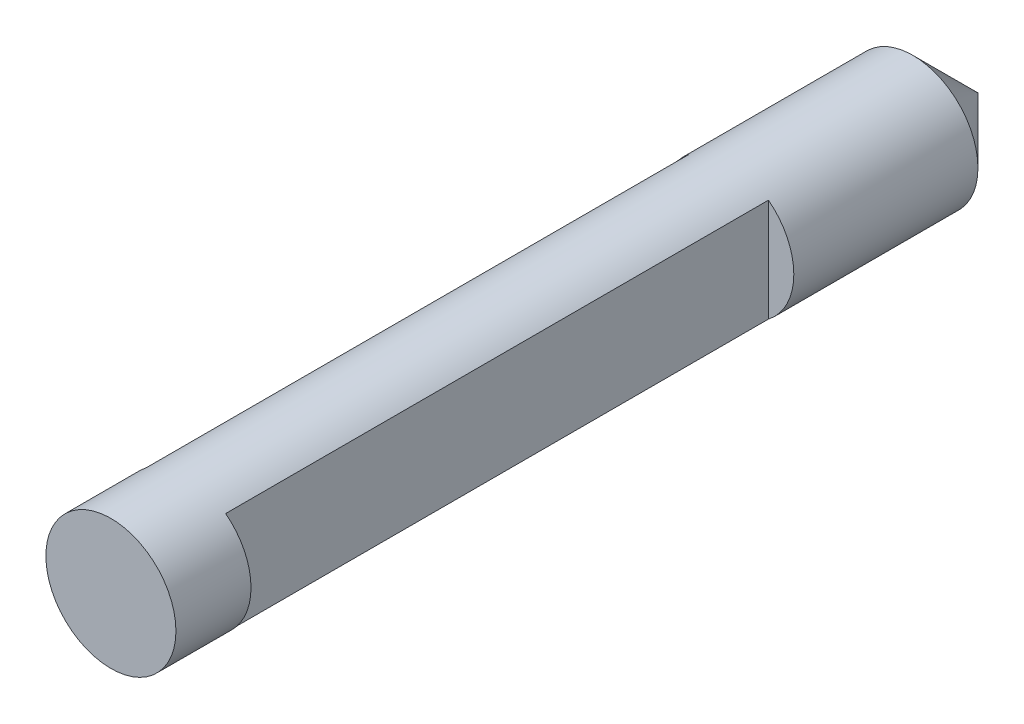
from build123d import *

# Parameters (mm, degrees)
SKETCH1_R               = 3.75
BOSS_EXTRUDE1_DEPTH     = 50
CUT_EXTRUDE1_DEPTH      = 50
CUT_EXTRUDE1_DEPTH_BACK = 50
SKETCH4_W               = 3.100671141
SKETCH4_H               = 31.302013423


with BuildPart() as part:
    # Sketch1 → Boss-Extrude1 (new body)
    with BuildSketch(Plane.XY):
        Circle(SKETCH1_R)
    extrude(amount=BOSS_EXTRUDE1_DEPTH)

    # Sketch2 → Cut-Revolve1 (revolve, cut)
    with BuildSketch(Plane(origin=(0, 0, 0), x_dir=(0, 0, -1), z_dir=(1, 0, 0)), mode=Mode.PRIVATE) as cut_revolve1_sk:
        with BuildLine():
            Line((-0.006026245, 0.006026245), (-3.75, 3.75))
            Line((-3.75, 3.75), (-0.510770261, 9.02101447))
            Line((-0.510770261, 9.02101447), (4.208147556, 3.043718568))
            Line((4.208147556, 3.043718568), (0.006905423, 0.004994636))
            ThreePointArc((0.006905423, 0.004994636), (0.000249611, 0.003128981), (-0.006026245, 0.006026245))
        make_face()
    revolve(cut_revolve1_sk.sketch.rotate(Axis((0, 0, -7.17432447), (0, 0, 1)), 270), axis=Axis((0, 0, -7.17432447), (0, 0, 1)), mode=Mode.SUBTRACT)

    # Sketch4 → Cut-Extrude1 (cut, two sides: drawn at the far end of the back side and taken through both)
    with BuildSketch(Plane(origin=(0, 0, 0), x_dir=(1, 0, 0), z_dir=(0, 1, 0)).offset(-CUT_EXTRUDE1_DEPTH_BACK)):
        with Locations((3.838926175, -30.020134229)):
            Rectangle(SKETCH4_W, SKETCH4_H)
        with Locations((-3.838926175, -30.020134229)):
            Rectangle(SKETCH4_W, SKETCH4_H)
    extrude(amount=CUT_EXTRUDE1_DEPTH + CUT_EXTRUDE1_DEPTH_BACK, mode=Mode.SUBTRACT)


solid = part.part
